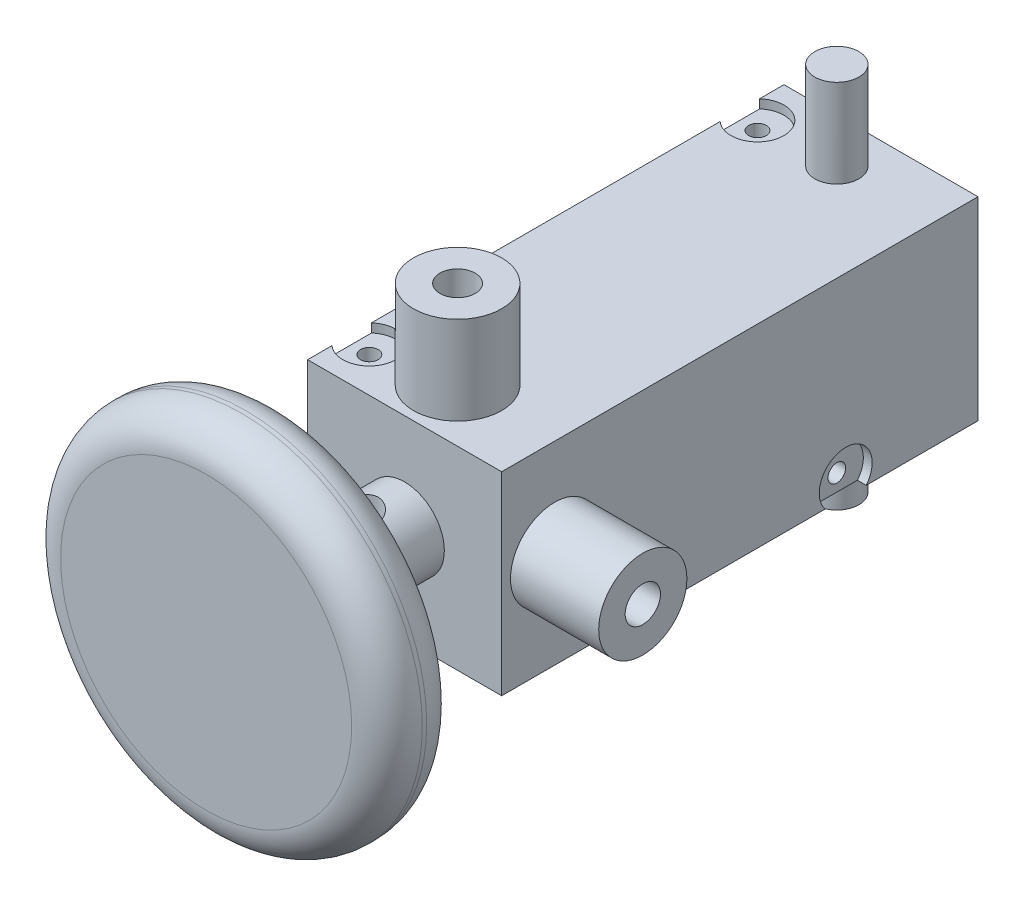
from build123d import *

# Parameters (mm, degrees)
ESQUISSE1_W                     = 22
ESQUISSE1_H                     = 22
EXTRUSION1_DEPTH                = 54
ESQUISSE2_R                     = 4.5
EXTRUSION2_DEPTH                = 14
ESQUISSE3_R                     = 20.5
EXTRUSION3_DEPTH                = 8.5
CONG_1_R                        = 4
EXTRUSION4_DEPTH                = 10
EXTRUSION4_DEPTH_BACK           = 32
ESQUISSE4_R                     = 2.5
ESQUISSE5_R                     = 5
EXTRUSION5_DEPTH                = 10
ESQUISSE6_R                     = 5
EXTRUSION6_DEPTH                = 10
TROU_TARAUD_M4X0_71_D           = 3.3
TROU_TARAUD_M4X0_71_DEPTH       = 30.1
TROU_TARAUD_M4X0_71_CBORE_D     = 4
TROU_TARAUD_M4X0_71_CBORE_DEPTH = 28
TROU_TARAUD_M4X0_71_TIP         = 0.991420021
TROU_TARAUD_M4X0_72_D           = 3.3
TROU_TARAUD_M4X0_72_DEPTH       = 30.1
TROU_TARAUD_M4X0_72_CBORE_D     = 4
TROU_TARAUD_M4X0_72_CBORE_DEPTH = 28
TROU_TARAUD_M4X0_72_TIP         = 0.991420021
TROU_TARAUD_M4X0_75_D           = 3.3
TROU_TARAUD_M4X0_75_CBORE_D     = 4
TROU_TARAUD_M4X0_75_CBORE_DEPTH = 10
TROU_TARAUD_M4X0_76_D           = 3.3
TROU_TARAUD_M4X0_76_DEPTH       = 13.5
TROU_TARAUD_M4X0_76_CBORE_D     = 4
TROU_TARAUD_M4X0_76_CBORE_DEPTH = 10
TROU_TARAUD_M4X0_76_TIP         = 0.991420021
TROU_TARAUD_M2X0_41_D           = 1.6
TROU_TARAUD_M2X0_41_DEPTH       = 6
TROU_TARAUD_M2X0_41_CBORE_D     = 2
TROU_TARAUD_M2X0_41_CBORE_DEPTH = 4
TROU_TARAUD_M2X0_41_TIP         = 0.480688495
TROU_TARAUD_M2X0_42_D           = 1.6
TROU_TARAUD_M2X0_42_DEPTH       = 6
TROU_TARAUD_M2X0_42_CBORE_D     = 2
TROU_TARAUD_M2X0_42_CBORE_DEPTH = 4
TROU_TARAUD_M2X0_42_TIP         = 0.480688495
ESQUISSE24_R                    = 3
ENL_V_MAT_EXTRU_1_DEPTH         = 1
ESQUISSE25_R                    = 3
ENL_V_MAT_EXTRU_2_DEPTH         = 1
TROU_TARAUD_M2X0_43_AT_2_COUNT  = 2
TROU_TARAUD_M2X0_43_AT_2_PITCH  = 44
TROU_TARAUD_M2X0_44_D           = 1.6
TROU_TARAUD_M2X0_44_DEPTH       = 6
TROU_TARAUD_M2X0_44_CBORE_D     = 2
TROU_TARAUD_M2X0_44_CBORE_DEPTH = 4
TROU_TARAUD_M2X0_44_TIP         = 0.480688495


with BuildPart() as part:
    # Esquisse1 → Extrusion1 (new body)
    with BuildSketch(Plane.XY):
        with Locations((-11, 11)):
            Rectangle(ESQUISSE1_W, ESQUISSE1_H)
    extrude(amount=EXTRUSION1_DEPTH)

    # Esquisse2 → Extrusion2 (add)
    with BuildSketch(Plane.XY.offset(54)):
        with Locations((-11, 11)):
            Circle(ESQUISSE2_R)
    extrude(amount=EXTRUSION2_DEPTH)

    # Esquisse3 → Extrusion3 (add)
    with BuildSketch(Plane.XY.offset(68)):
        with Locations((-11, 11)):
            Circle(ESQUISSE3_R)
    extrude(amount=EXTRUSION3_DEPTH)

    # Cong_1
    cong_1_edges = [part.edges().sort_by_distance(p)[0] for p in [
        (-31.5, 11, 68),
        (-31.5, 11, 76.5),
    ]]
    fillet(cong_1_edges, radius=CONG_1_R)

    # Esquisse4 → Extrusion4 (add, two sides: drawn at the far end of the back side and taken through both)
    with BuildSketch(Plane(origin=(0, 22, 0), x_dir=(-1, 0, 0), z_dir=(0, 1, 0)).offset(-EXTRUSION4_DEPTH_BACK)):
        with Locations((11, 5)):
            Circle(ESQUISSE4_R)
    extrude(amount=EXTRUSION4_DEPTH + EXTRUSION4_DEPTH_BACK)

    # Esquisse5 → Extrusion5 (add)
    with BuildSketch(Plane(origin=(0, 0, 0), x_dir=(0, 0, -1), z_dir=(1, 0, 0))):
        with Locations(Location((-48, 11, 0), (0, 0, 180))):
            Circle(ESQUISSE5_R)
    extrude(amount=EXTRUSION5_DEPTH)

    # Esquisse6 → Extrusion6 (add)
    with BuildSketch(Plane(origin=(0, 22, 0), x_dir=(-1, 0, 0), z_dir=(0, 1, 0))):
        with Locations(Location((11, 48, 0), (0, 0, 270))):
            Circle(ESQUISSE6_R)
    extrude(amount=EXTRUSION6_DEPTH)

    # Trou taraud_ M4x0.71
    with Locations(Plane(origin=(0, 32, 0), x_dir=(-1, 0, 0), z_dir=(0, 1, 0))):
        with Locations((11, 48)):
            CounterBoreHole(TROU_TARAUD_M4X0_71_D / 2, TROU_TARAUD_M4X0_71_CBORE_D / 2, TROU_TARAUD_M4X0_71_CBORE_DEPTH, depth=TROU_TARAUD_M4X0_71_DEPTH)
            with Locations((0, 0, -(TROU_TARAUD_M4X0_71_DEPTH + TROU_TARAUD_M4X0_71_TIP / 2))):  # 118° drill point
                Cone(0, TROU_TARAUD_M4X0_71_D / 2, TROU_TARAUD_M4X0_71_TIP, mode=Mode.SUBTRACT)

    # Trou taraud_ M4x0.72
    with Locations(Plane(origin=(10, 0, 0), x_dir=(0, 0, -1), z_dir=(1, 0, 0))):
        with Locations((-48, 11)):
            CounterBoreHole(TROU_TARAUD_M4X0_72_D / 2, TROU_TARAUD_M4X0_72_CBORE_D / 2, TROU_TARAUD_M4X0_72_CBORE_DEPTH, depth=TROU_TARAUD_M4X0_72_DEPTH)
            with Locations((0, 0, -(TROU_TARAUD_M4X0_72_DEPTH + TROU_TARAUD_M4X0_72_TIP / 2))):  # 118° drill point
                Cone(0, TROU_TARAUD_M4X0_72_D / 2, TROU_TARAUD_M4X0_72_TIP, mode=Mode.SUBTRACT)

    # Trou taraud_ M4x0.75 (through all)
    with Locations(Plane(origin=(-6.5, 11, 63.5), x_dir=(0, 0, 1), z_dir=(1, 0, 0))):
        with Locations((0, 0)):
            CounterBoreHole(TROU_TARAUD_M4X0_75_D / 2, TROU_TARAUD_M4X0_75_CBORE_D / 2, TROU_TARAUD_M4X0_75_CBORE_DEPTH)

    # Trou taraud_ M4x0.76
    with Locations(Plane(origin=(-11, 15.5, 59), x_dir=(0, 0, 1), z_dir=(0, 1, 0))):
        with Locations((0, 0)):
            CounterBoreHole(TROU_TARAUD_M4X0_76_D / 2, TROU_TARAUD_M4X0_76_CBORE_D / 2, TROU_TARAUD_M4X0_76_CBORE_DEPTH, depth=TROU_TARAUD_M4X0_76_DEPTH)
            with Locations((0, 0, -(TROU_TARAUD_M4X0_76_DEPTH + TROU_TARAUD_M4X0_76_TIP / 2))):  # 118° drill point
                Cone(0, TROU_TARAUD_M4X0_76_D / 2, TROU_TARAUD_M4X0_76_TIP, mode=Mode.SUBTRACT)

    # Trou taraud_ M2x0.41
    with Locations(Plane.ZY.offset(22)):
        with Locations((46.5, 3), (30.5, 19), (23.5, 19), (7.5, 3)):
            CounterBoreHole(TROU_TARAUD_M2X0_41_D / 2, TROU_TARAUD_M2X0_41_CBORE_D / 2, TROU_TARAUD_M2X0_41_CBORE_DEPTH, depth=TROU_TARAUD_M2X0_41_DEPTH)
            with Locations((0, 0, -(TROU_TARAUD_M2X0_41_DEPTH + TROU_TARAUD_M2X0_41_TIP / 2))):  # 118° drill point
                Cone(0, TROU_TARAUD_M2X0_41_D / 2, TROU_TARAUD_M2X0_41_TIP, mode=Mode.SUBTRACT)

    # Trou taraud_ M2x0.42
    with Locations(Plane.XZ):
        with Locations((-3, 18.5), (-19, 34.5)):
            CounterBoreHole(TROU_TARAUD_M2X0_42_D / 2, TROU_TARAUD_M2X0_42_CBORE_D / 2, TROU_TARAUD_M2X0_42_CBORE_DEPTH, depth=TROU_TARAUD_M2X0_42_DEPTH)
            with Locations((0, 0, -(TROU_TARAUD_M2X0_42_DEPTH + TROU_TARAUD_M2X0_42_TIP / 2))):  # 118° drill point
                Cone(0, TROU_TARAUD_M2X0_42_D / 2, TROU_TARAUD_M2X0_42_TIP, mode=Mode.SUBTRACT)

    # Esquisse24 → Enl_v. mat.-Extru.1 (cut)
    with BuildSketch(Plane.XZ):
        with Locations((-20, 49)):
            Circle(ESQUISSE24_R)
        with Locations((-20, 5)):
            Circle(ESQUISSE24_R)
    enl_v_mat_extru_1 = extrude(amount=-ENL_V_MAT_EXTRU_1_DEPTH, mode=Mode.SUBTRACT)

    # Sym_trie1: Enl_v. mat.-Extru.1 across plane
    add(enl_v_mat_extru_1.mirror(Plane.ZX.offset(11)), mode=Mode.SUBTRACT)

    # Esquisse25 → Enl_v. mat.-Extru.2 (cut)
    with BuildSketch(Plane(origin=(0, 0, 0), x_dir=(0, 0, -1), z_dir=(1, 0, 0))):
        with Locations((-15, 1.890399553)):
            Circle(ESQUISSE25_R)
        with Locations((-38, 1.890399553)):
            Circle(ESQUISSE25_R)
    extrude(amount=-ENL_V_MAT_EXTRU_2_DEPTH, mode=Mode.SUBTRACT)

    # Esquisse26 → Trou taraud_ M2x0.43 (revolve, cut)
    with BuildSketch(Plane(origin=(-20, 1, 5), x_dir=(0, 0, -1), z_dir=(1, 0, 0))):
        Polygon((0, 0), (0, 6.480688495), (0.8, 6), (0.8, 4), (1, 4), (1, 0), align=None)
    trou_taraud_m2x0_43 = revolve(axis=Axis((-20, -5.35, 5), (0, 1, 0)), mode=Mode.SUBTRACT)

    # Trou taraud_ M2x0.43 at 2: Trou taraud_ M2x0.43 ×2
    with Locations(*[(0, 0, i * TROU_TARAUD_M2X0_43_AT_2_PITCH) for i in range(1, TROU_TARAUD_M2X0_43_AT_2_COUNT)]):
        add(trou_taraud_m2x0_43, mode=Mode.SUBTRACT)

    # Trou taraud_ M2x0.44
    with Locations(Plane(origin=(-1, 0, 0), x_dir=(0, 0, -1), z_dir=(1, 0, 0))):
        with Locations((-38, 1.890399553), (-15, 1.890399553)):
            CounterBoreHole(TROU_TARAUD_M2X0_44_D / 2, TROU_TARAUD_M2X0_44_CBORE_D / 2, TROU_TARAUD_M2X0_44_CBORE_DEPTH, depth=TROU_TARAUD_M2X0_44_DEPTH)
            with Locations((0, 0, -(TROU_TARAUD_M2X0_44_DEPTH + TROU_TARAUD_M2X0_44_TIP / 2))):  # 118° drill point
                Cone(0, TROU_TARAUD_M2X0_44_D / 2, TROU_TARAUD_M2X0_44_TIP, mode=Mode.SUBTRACT)

    # Sym_trie2: Trou taraud_ M2x0.43 across plane
    add(trou_taraud_m2x0_43.mirror(Plane.ZX.offset(11)), mode=Mode.SUBTRACT)

    # Sym_trie2 copy 1 sketch → Sym_trie2 copy 1 (revolve, cut)
    with BuildSketch(Plane(origin=(-20, 21, 49), x_dir=(0, 0, -1), z_dir=(1, 0, 0))):
        Polygon((0, 0), (0, -6.480688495), (0.8, -6), (0.8, -4), (1, -4), (1, 0), align=None)
    revolve(axis=Axis((-20, 27.35, 49), (0, 1, 0)), mode=Mode.SUBTRACT)


solid = part.part
